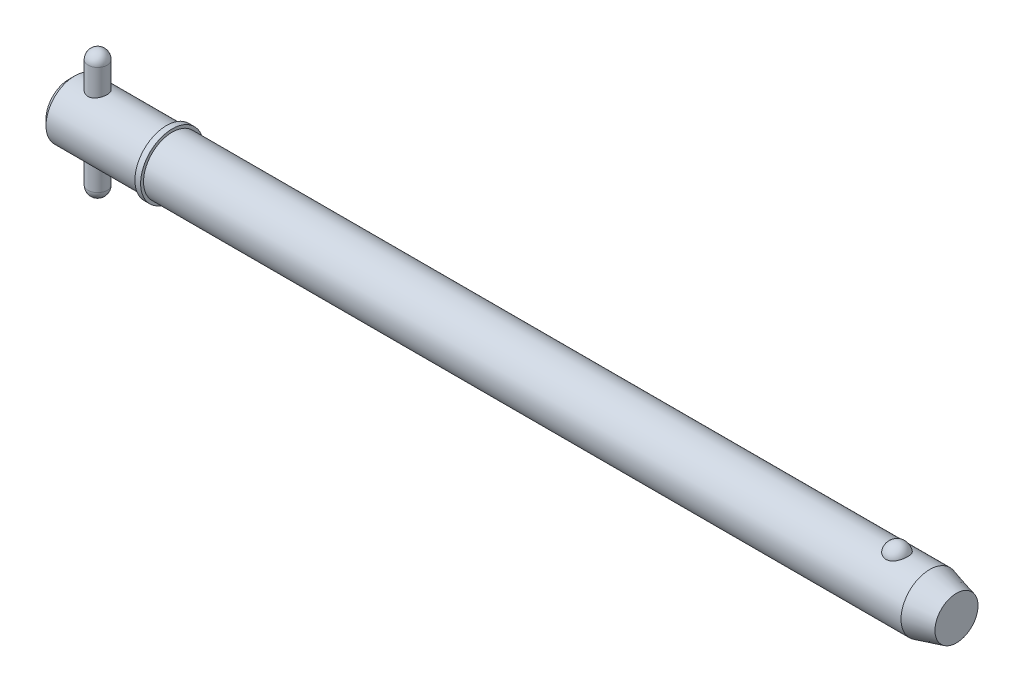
ISO-10303-21;
HEADER;
FILE_DESCRIPTION(('STEP AP214'),'2;1');
FILE_NAME('part.step','',(''),(''),'','','');
FILE_SCHEMA(('AUTOMOTIVE_DESIGN { 1 0 10303 214 1 1 1 1 }'));
ENDSEC;
DATA;
#1=APPLICATION_CONTEXT('core data for automotive mechanical design processes');
#2=APPLICATION_PROTOCOL_DEFINITION('international standard','automotive_design',2000,#1);
#3=PRODUCT_CONTEXT('',#1,'mechanical');
#4=PRODUCT('Part','Part','',(#3));
#5=PRODUCT_RELATED_PRODUCT_CATEGORY('part','',(#4));
#6=PRODUCT_DEFINITION_FORMATION('','',#4);
#7=PRODUCT_DEFINITION_CONTEXT('part definition',#1,'design');
#8=PRODUCT_DEFINITION('design','',#6,#7);
#9=PRODUCT_DEFINITION_SHAPE('','',#8);
#10=(LENGTH_UNIT() NAMED_UNIT(*) SI_UNIT(.MILLI.,.METRE.));
#11=(NAMED_UNIT(*) PLANE_ANGLE_UNIT() SI_UNIT($,.RADIAN.));
#12=(NAMED_UNIT(*) SI_UNIT($,.STERADIAN.) SOLID_ANGLE_UNIT());
#13=UNCERTAINTY_MEASURE_WITH_UNIT(LENGTH_MEASURE(1.E-05),#10,'distance_accuracy_value','');
#14=(GEOMETRIC_REPRESENTATION_CONTEXT(3) GLOBAL_UNCERTAINTY_ASSIGNED_CONTEXT((#13)) GLOBAL_UNIT_ASSIGNED_CONTEXT((#10,
#11,#12)) REPRESENTATION_CONTEXT('',''));
#15=CARTESIAN_POINT('',(0.,0.,0.));
#16=DIRECTION('',(0.,0.,1.));
#17=DIRECTION('',(1.,0.,0.));
#18=AXIS2_PLACEMENT_3D('',#15,#16,#17);
#19=CARTESIAN_POINT('',(7.14,15.875,0.));
#20=DIRECTION('',(0.,-1.,0.));
#21=DIRECTION('',(0.,0.,-1.));
#22=AXIS2_PLACEMENT_3D('',#19,#20,#21);
#23=CYLINDRICAL_SURFACE('',#22,2.38);
#24=CARTESIAN_POINT('',(7.14,-13.495,0.));
#25=DIRECTION('',(0.,-1.,0.));
#26=DIRECTION('',(0.,0.,-1.));
#27=AXIS2_PLACEMENT_3D('',#24,#25,#26);
#28=CIRCLE('',#27,2.38);
#29=CARTESIAN_POINT('',(7.14,-13.495,-2.38));
#30=VERTEX_POINT('',#29);
#31=EDGE_CURVE('P0_E10',#30,#30,#28,.F.);
#32=ORIENTED_EDGE('',*,*,#31,.T.);
#33=EDGE_LOOP('',(#32));
#34=FACE_BOUND('',#33,.T.);
#35=CARTESIAN_POINT('',(7.14,13.495,0.));
#36=DIRECTION('',(0.,-1.,0.));
#37=DIRECTION('',(0.,0.,-1.));
#38=AXIS2_PLACEMENT_3D('',#35,#36,#37);
#39=CIRCLE('',#38,2.38);
#40=CARTESIAN_POINT('',(7.14,13.495,-2.38));
#41=VERTEX_POINT('',#40);
#42=EDGE_CURVE('P0_E21',#41,#41,#39,.T.);
#43=ORIENTED_EDGE('',*,*,#42,.T.);
#44=EDGE_LOOP('',(#43));
#45=FACE_BOUND('',#44,.T.);
#46=ADVANCED_FACE('P0_F14',(#34,#45),#23,.T.);
#47=CARTESIAN_POINT('',(7.14,-13.495,0.));
#48=DIRECTION('',(0.,0.,1.));
#49=DIRECTION('',(1.,0.,0.));
#50=AXIS2_PLACEMENT_3D('',#47,#48,#49);
#51=SPHERICAL_SURFACE('',#50,2.38);
#52=CARTESIAN_POINT('',(7.14,-13.495,0.));
#53=DIRECTION('',(0.,-1.,0.));
#54=DIRECTION('',(0.,0.,-1.));
#55=AXIS2_PLACEMENT_3D('',#52,#53,#54);
#56=SPHERICAL_SURFACE('',#55,2.38);
#57=ORIENTED_EDGE('',*,*,#31,.F.);
#58=EDGE_LOOP('',(#57));
#59=FACE_BOUND('',#58,.T.);
#60=ADVANCED_FACE('P0_F29',(#59),#56,.T.);
#61=CARTESIAN_POINT('',(7.14,13.495,0.));
#62=DIRECTION('',(0.,0.,1.));
#63=DIRECTION('',(1.,0.,0.));
#64=AXIS2_PLACEMENT_3D('',#61,#62,#63);
#65=SPHERICAL_SURFACE('',#64,2.38);
#66=CARTESIAN_POINT('',(7.14,13.495,0.));
#67=DIRECTION('',(0.,-1.,0.));
#68=DIRECTION('',(0.,0.,-1.));
#69=AXIS2_PLACEMENT_3D('',#66,#67,#68);
#70=SPHERICAL_SURFACE('',#69,2.38);
#71=ORIENTED_EDGE('',*,*,#42,.F.);
#72=EDGE_LOOP('',(#71));
#73=FACE_BOUND('',#72,.T.);
#74=ADVANCED_FACE('P0_F16',(#73),#70,.T.);
#75=CLOSED_SHELL('',(#46,#60,#74));
#76=MANIFOLD_SOLID_BREP('P0_B1',#75);
#77=CARTESIAN_POINT('',(0.,0.,0.));
#78=DIRECTION('',(1.,0.,0.));
#79=DIRECTION('',(0.,0.,-1.));
#80=AXIS2_PLACEMENT_3D('',#77,#78,#79);
#81=CYLINDRICAL_SURFACE('',#80,7.145);
#82=CARTESIAN_POINT('',(214.28362424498,0.,0.));
#83=DIRECTION('',(1.,0.,0.));
#84=DIRECTION('',(0.,0.,-1.));
#85=AXIS2_PLACEMENT_3D('',#82,#83,#84);
#86=CIRCLE('',#85,7.145);
#87=CARTESIAN_POINT('',(214.28362424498,0.,-7.145));
#88=VERTEX_POINT('',#87);
#89=EDGE_CURVE('P1_E81',#88,#88,#86,.T.);
#90=ORIENTED_EDGE('',*,*,#89,.F.);
#91=EDGE_LOOP('',(#90));
#92=FACE_BOUND('',#91,.T.);
#93=CARTESIAN_POINT('',(25.7,0.,0.));
#94=DIRECTION('',(1.,0.,0.));
#95=DIRECTION('',(0.,0.,-1.));
#96=AXIS2_PLACEMENT_3D('',#93,#94,#95);
#97=CIRCLE('',#96,7.145);
#98=CARTESIAN_POINT('',(25.7,0.,-7.145));
#99=VERTEX_POINT('',#98);
#100=EDGE_CURVE('P1_E85',#99,#99,#97,.T.);
#101=ORIENTED_EDGE('',*,*,#100,.T.);
#102=EDGE_LOOP('',(#101));
#103=FACE_BOUND('',#102,.T.);
#104=CARTESIAN_POINT('',(206.139503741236,6.60328629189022,2.72903557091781));
#105=CARTESIAN_POINT('',(205.998315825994,6.60329644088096,2.72902496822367));
#106=CARTESIAN_POINT('',(205.856883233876,6.60799490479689,2.71772840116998));
#107=CARTESIAN_POINT('',(205.577955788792,6.62628236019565,2.67281935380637));
#108=CARTESIAN_POINT('',(205.440472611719,6.63989534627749,2.6391466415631));
#109=CARTESIAN_POINT('',(205.173889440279,6.67440775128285,2.55059642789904));
#110=CARTESIAN_POINT('',(205.044768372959,6.69528793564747,2.49577486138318));
#111=CARTESIAN_POINT('',(204.797869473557,6.74205585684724,2.36651799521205));
#112=CARTESIAN_POINT('',(204.680086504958,6.76794130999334,2.29209163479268));
#113=CARTESIAN_POINT('',(204.45516710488,6.82286177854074,2.12312937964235));
#114=CARTESIAN_POINT('',(204.348440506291,6.85196655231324,2.02807107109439));
#115=CARTESIAN_POINT('',(204.151918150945,6.90970232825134,1.82167822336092));
#116=CARTESIAN_POINT('',(204.062127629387,6.93833318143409,1.71033867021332));
#117=CARTESIAN_POINT('',(203.897667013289,6.9935167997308,1.46891951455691));
#118=CARTESIAN_POINT('',(203.823844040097,7.01992110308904,1.33822781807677));
#119=CARTESIAN_POINT('',(203.698088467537,7.06643385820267,1.06566567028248));
#120=CARTESIAN_POINT('',(203.64615735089,7.08654188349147,0.923794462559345));
#121=CARTESIAN_POINT('',(203.564732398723,7.11862399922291,0.630993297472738));
#122=CARTESIAN_POINT('',(203.535516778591,7.13049704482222,0.47997470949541));
#123=CARTESIAN_POINT('',(203.501174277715,7.14449484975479,0.174782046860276));
#124=CARTESIAN_POINT('',(203.496046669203,7.14661990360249,0.0206080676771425));
#125=CARTESIAN_POINT('',(203.509938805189,7.14092465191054,-0.285506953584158));
#126=CARTESIAN_POINT('',(203.528810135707,7.1331654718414,-0.437455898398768));
#127=CARTESIAN_POINT('',(203.590062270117,7.10859076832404,-0.735778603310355));
#128=CARTESIAN_POINT('',(203.632443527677,7.0917750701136,-0.882152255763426));
#129=CARTESIAN_POINT('',(203.739934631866,7.05076716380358,-1.165431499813));
#130=CARTESIAN_POINT('',(203.805075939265,7.02656475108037,-1.30232366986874));
#131=CARTESIAN_POINT('',(203.956759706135,6.97329145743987,-1.56265907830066));
#132=CARTESIAN_POINT('',(204.043303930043,6.94422017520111,-1.68610120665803));
#133=CARTESIAN_POINT('',(204.236465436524,6.88415108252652,-1.91671004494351));
#134=CARTESIAN_POINT('',(204.343180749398,6.85314438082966,-2.02379244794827));
#135=CARTESIAN_POINT('',(204.573974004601,6.79282069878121,-2.21787433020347));
#136=CARTESIAN_POINT('',(204.698050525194,6.76350358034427,-2.30487545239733));
#137=CARTESIAN_POINT('',(204.957678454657,6.71060580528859,-2.45458647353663));
#138=CARTESIAN_POINT('',(205.092938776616,6.68691885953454,-2.51776240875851));
#139=CARTESIAN_POINT('',(205.373277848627,6.64741247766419,-2.62030218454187));
#140=CARTESIAN_POINT('',(205.518352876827,6.63159007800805,-2.65967499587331));
#141=CARTESIAN_POINT('',(205.806347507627,6.61038594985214,-2.71193301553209));
#142=CARTESIAN_POINT('',(205.94900807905,6.60451880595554,-2.72605165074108));
#143=CARTESIAN_POINT('',(206.234800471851,6.60240611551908,-2.73116688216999));
#144=CARTESIAN_POINT('',(206.377932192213,6.60615862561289,-2.72216814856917));
#145=CARTESIAN_POINT('',(206.655848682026,6.62256094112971,-2.68200435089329));
#146=CARTESIAN_POINT('',(206.790754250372,6.63492533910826,-2.65154998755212));
#147=CARTESIAN_POINT('',(207.05332009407,6.66687445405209,-2.57015684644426));
#148=CARTESIAN_POINT('',(207.18097978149,6.68645975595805,-2.51921640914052));
#149=CARTESIAN_POINT('',(207.428577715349,6.73127274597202,-2.3969361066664));
#150=CARTESIAN_POINT('',(207.548287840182,6.75661381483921,-2.32517694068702));
#151=CARTESIAN_POINT('',(207.774159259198,6.81006003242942,-2.16363812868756));
#152=CARTESIAN_POINT('',(207.880317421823,6.83816581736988,-2.07385432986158));
#153=CARTESIAN_POINT('',(208.081862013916,6.8958046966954,-1.87357235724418));
#154=CARTESIAN_POINT('',(208.176440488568,6.92533863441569,-1.76226074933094));
#155=CARTESIAN_POINT('',(208.346332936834,6.981395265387,-1.52511696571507));
#156=CARTESIAN_POINT('',(208.421643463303,7.00791741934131,-1.39928219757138));
#157=CARTESIAN_POINT('',(208.553595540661,7.05607625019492,-1.13215977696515));
#158=CARTESIAN_POINT('',(208.609568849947,7.07753119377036,-0.990508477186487));
#159=CARTESIAN_POINT('',(208.698296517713,7.11222355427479,-0.699154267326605));
#160=CARTESIAN_POINT('',(208.731050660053,7.12546089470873,-0.549451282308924));
#161=CARTESIAN_POINT('',(208.772689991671,7.14237584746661,-0.246120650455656));
#162=CARTESIAN_POINT('',(208.781558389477,7.14604673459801,-0.0924903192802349));
#163=CARTESIAN_POINT('',(208.775194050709,7.14343510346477,0.214181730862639));
#164=CARTESIAN_POINT('',(208.759961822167,7.13715279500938,0.367223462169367));
#165=CARTESIAN_POINT('',(208.705845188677,7.1153294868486,0.667595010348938));
#166=CARTESIAN_POINT('',(208.667077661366,7.09983424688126,0.814949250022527));
#167=CARTESIAN_POINT('',(208.566770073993,7.06119140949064,1.10063221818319));
#168=CARTESIAN_POINT('',(208.505228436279,7.03804328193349,1.238960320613));
#169=CARTESIAN_POINT('',(208.360207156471,6.98632429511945,1.50352300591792));
#170=CARTESIAN_POINT('',(208.276606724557,6.95772382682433,1.62968561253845));
#171=CARTESIAN_POINT('',(208.08938046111,6.89823072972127,1.86554304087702));
#172=CARTESIAN_POINT('',(207.985755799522,6.86733823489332,1.97523882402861));
#173=CARTESIAN_POINT('',(207.761076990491,6.80676456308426,2.17482293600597));
#174=CARTESIAN_POINT('',(207.640067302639,6.77708053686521,2.2647603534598));
#175=CARTESIAN_POINT('',(207.383340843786,6.72230501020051,2.42252989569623));
#176=CARTESIAN_POINT('',(207.24761851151,6.69721525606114,2.49035362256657));
#177=CARTESIAN_POINT('',(206.970402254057,6.65552591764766,2.59967646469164));
#178=CARTESIAN_POINT('',(206.829281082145,6.63865794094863,2.64202017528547));
#179=CARTESIAN_POINT('',(206.541444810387,6.61425039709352,2.70255841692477));
#180=CARTESIAN_POINT('',(206.394748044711,6.60668259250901,2.72082606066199));
#181=CARTESIAN_POINT('',(206.211679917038,6.60358754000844,2.72830331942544));
#182=CARTESIAN_POINT('',(206.175599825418,6.60328369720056,2.72903828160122));
#183=CARTESIAN_POINT('',(206.139503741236,6.60328629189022,2.72903557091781));
#184=B_SPLINE_CURVE_WITH_KNOTS('',3,(#104,#105,#106,#107,#108,#109,#110,#111,#112,#113,#114,
#115,#116,#117,#118,#119,#120,#121,#122,#123,#124,#125,#126,#127,#128,#129,#130,#131,#132,#133,
#134,#135,#136,#137,#138,#139,#140,#141,#142,#143,#144,#145,#146,#147,#148,#149,#150,#151,#152,
#153,#154,#155,#156,#157,#158,#159,#160,#161,#162,#163,#164,#165,#166,#167,#168,#169,#170,#171,
#172,#173,#174,#175,#176,#177,#178,#179,#180,#181,#182,#183),.UNSPECIFIED.,.T.,.F.,(4,2,2,2,2,2,
2,2,2,2,2,2,2,2,2,2,2,2,2,2,2,2,2,2,2,2,2,2,2,2,2,2,2,2,2,2,2,2,2,4),(0.,0.423468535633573,
0.848081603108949,1.27157926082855,1.69488414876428,2.13051395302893,2.56627819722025,
3.0213670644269,3.47648674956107,3.93709649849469,4.39769233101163,4.85545355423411,
5.31322361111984,5.77162895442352,6.23007210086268,6.69080337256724,7.15149693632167,
7.60264329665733,8.05361952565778,8.48189729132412,8.91008854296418,9.32472524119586,
9.73939553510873,10.1630783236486,10.5868588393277,11.0319070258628,11.4770347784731,
11.9362874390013,12.3955443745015,12.855124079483,13.3146940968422,13.7720003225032,
14.2293382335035,14.6892343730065,15.1491036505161,15.6078171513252,16.0667046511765,
16.5093965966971,16.9507410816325,17.0590049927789),.UNSPECIFIED.);
#185=CARTESIAN_POINT('',(206.139503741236,6.60328629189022,2.72903557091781));
#186=VERTEX_POINT('',#185);
#187=EDGE_CURVE('P1_E35',#186,#186,#184,.T.);
#188=ORIENTED_EDGE('',*,*,#187,.T.);
#189=EDGE_LOOP('',(#188));
#190=FACE_BOUND('',#189,.T.);
#191=ADVANCED_FACE('P1_F13',(#92,#103,#190),#81,.T.);
#192=CARTESIAN_POINT('',(0.,0.,0.));
#193=DIRECTION('',(-1.,0.,0.));
#194=DIRECTION('',(0.,0.,1.));
#195=AXIS2_PLACEMENT_3D('',#192,#193,#194);
#196=PLANE('',#195);
#197=CARTESIAN_POINT('',(0.,0.,0.));
#198=DIRECTION('',(1.,0.,0.));
#199=DIRECTION('',(0.,0.,-1.));
#200=AXIS2_PLACEMENT_3D('',#197,#198,#199);
#201=CIRCLE('',#200,5.716);
#202=CARTESIAN_POINT('',(0.,0.,-5.716));
#203=VERTEX_POINT('',#202);
#204=EDGE_CURVE('P1_E9',#203,#203,#201,.T.);
#205=ORIENTED_EDGE('',*,*,#204,.F.);
#206=EDGE_LOOP('',(#205));
#207=FACE_BOUND('',#206,.T.);
#208=ADVANCED_FACE('P1_F15',(#207),#196,.T.);
#209=CARTESIAN_POINT('',(1.42899999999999,0.,0.));
#210=DIRECTION('',(1.,0.,0.));
#211=DIRECTION('',(0.,0.,-1.));
#212=AXIS2_PLACEMENT_3D('',#209,#210,#211);
#213=CONICAL_SURFACE('',#212,7.145,0.78539816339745);
#214=ORIENTED_EDGE('',*,*,#204,.T.);
#215=EDGE_LOOP('',(#214));
#216=FACE_BOUND('',#215,.T.);
#217=CARTESIAN_POINT('',(1.42899999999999,0.,0.));
#218=DIRECTION('',(1.,0.,0.));
#219=DIRECTION('',(0.,0.,-1.));
#220=AXIS2_PLACEMENT_3D('',#217,#218,#219);
#221=CIRCLE('',#220,7.145);
#222=CARTESIAN_POINT('',(1.42899999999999,0.,-7.145));
#223=VERTEX_POINT('',#222);
#224=EDGE_CURVE('P1_E26',#223,#223,#221,.T.);
#225=ORIENTED_EDGE('',*,*,#224,.F.);
#226=EDGE_LOOP('',(#225));
#227=FACE_BOUND('',#226,.T.);
#228=ADVANCED_FACE('P1_F77',(#216,#227),#213,.T.);
#229=CARTESIAN_POINT('',(0.,0.,0.));
#230=DIRECTION('',(1.,0.,0.));
#231=DIRECTION('',(0.,0.,-1.));
#232=AXIS2_PLACEMENT_3D('',#229,#230,#231);
#233=CYLINDRICAL_SURFACE('',#232,7.145);
#234=CARTESIAN_POINT('',(7.14,-6.73695962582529,2.38));
#235=CARTESIAN_POINT('',(7.01035997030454,-6.73695921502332,2.38000059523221));
#236=CARTESIAN_POINT('',(6.88072348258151,-6.74074253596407,2.36937183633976));
#237=CARTESIAN_POINT('',(6.62529075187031,-6.75538853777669,2.32728080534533));
#238=CARTESIAN_POINT('',(6.49949514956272,-6.76625239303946,2.29581507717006));
#239=CARTESIAN_POINT('',(6.2554858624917,-6.79369535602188,2.21327763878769));
#240=CARTESIAN_POINT('',(6.13725786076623,-6.81026326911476,2.16224430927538));
#241=CARTESIAN_POINT('',(5.91100349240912,-6.84723128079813,2.04215132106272));
#242=CARTESIAN_POINT('',(5.80297937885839,-6.86763222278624,1.97308769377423));
#243=CARTESIAN_POINT('',(5.59597854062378,-6.91086152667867,1.81600414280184));
#244=CARTESIAN_POINT('',(5.49745861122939,-6.93375032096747,1.72739874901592));
#245=CARTESIAN_POINT('',(5.31636508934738,-6.97886546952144,1.53499636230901));
#246=CARTESIAN_POINT('',(5.23379405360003,-7.00109171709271,1.43119693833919));
#247=CARTESIAN_POINT('',(5.08487013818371,-7.04307708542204,1.20801318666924));
#248=CARTESIAN_POINT('',(5.01899578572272,-7.06275685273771,1.08829330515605));
#249=CARTESIAN_POINT('',(4.90850130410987,-7.09671988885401,0.838703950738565));
#250=CARTESIAN_POINT('',(4.86387545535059,-7.11100460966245,0.70883722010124));
#251=CARTESIAN_POINT('',(4.79869354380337,-7.13213998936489,0.44742990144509));
#252=CARTESIAN_POINT('',(4.77735497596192,-7.13923172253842,0.316104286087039));
#253=CARTESIAN_POINT('',(4.75686536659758,-7.14603777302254,0.0515578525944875));
#254=CARTESIAN_POINT('',(4.75770861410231,-7.14575398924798,-0.0816624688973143));
#255=CARTESIAN_POINT('',(4.78106216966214,-7.13800438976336,-0.340678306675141));
#256=CARTESIAN_POINT('',(4.80272255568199,-7.13082030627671,-0.466560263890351));
#257=CARTESIAN_POINT('',(4.86569013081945,-7.11043095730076,-0.712788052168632));
#258=CARTESIAN_POINT('',(4.90699865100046,-7.09722528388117,-0.833133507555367));
#259=CARTESIAN_POINT('',(5.00858673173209,-7.06591754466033,-1.06673173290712));
#260=CARTESIAN_POINT('',(5.06910834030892,-7.0477534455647,-1.17987058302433));
#261=CARTESIAN_POINT('',(5.20720514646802,-7.00841977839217,-1.39463797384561));
#262=CARTESIAN_POINT('',(5.28478508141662,-6.987249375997,-1.49626330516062));
#263=CARTESIAN_POINT('',(5.4590800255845,-6.94296010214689,-1.69017445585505));
#264=CARTESIAN_POINT('',(5.55652324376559,-6.91979641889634,-1.78179645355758));
#265=CARTESIAN_POINT('',(5.76558873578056,-6.87497076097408,-1.94761348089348));
#266=CARTESIAN_POINT('',(5.87721318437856,-6.85330901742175,-2.02180583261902));
#267=CARTESIAN_POINT('',(6.11357367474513,-6.81369485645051,-2.15157488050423));
#268=CARTESIAN_POINT('',(6.23847358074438,-6.79579956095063,-2.20687188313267));
#269=CARTESIAN_POINT('',(6.49655785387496,-6.76640630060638,-2.29542443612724));
#270=CARTESIAN_POINT('',(6.62973872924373,-6.75490565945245,-2.32868920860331));
#271=CARTESIAN_POINT('',(6.89417536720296,-6.74020933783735,-2.37088225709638));
#272=CARTESIAN_POINT('',(7.02524746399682,-6.73666278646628,-2.38083959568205));
#273=CARTESIAN_POINT('',(7.28721035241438,-6.73729555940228,-2.37904974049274));
#274=CARTESIAN_POINT('',(7.41810117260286,-6.7414734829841,-2.36730648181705));
#275=CARTESIAN_POINT('',(7.67130717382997,-6.75673471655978,-2.32337336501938));
#276=CARTESIAN_POINT('',(7.79376251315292,-6.76757635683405,-2.29189834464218));
#277=CARTESIAN_POINT('',(8.03162917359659,-6.79467771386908,-2.21025275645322));
#278=CARTESIAN_POINT('',(8.14703924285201,-6.8109383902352,-2.16007887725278));
#279=CARTESIAN_POINT('',(8.37159169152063,-6.84768362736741,-2.04065289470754));
#280=CARTESIAN_POINT('',(8.48041962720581,-6.86828569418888,-1.97084668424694));
#281=CARTESIAN_POINT('',(8.68518919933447,-6.91116416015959,-1.8147657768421));
#282=CARTESIAN_POINT('',(8.78112702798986,-6.93344105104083,-1.72848623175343));
#283=CARTESIAN_POINT('',(8.96215574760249,-6.97845348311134,-1.53698616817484));
#284=CARTESIAN_POINT('',(9.04650427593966,-7.00115965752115,-1.43105491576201));
#285=CARTESIAN_POINT('',(9.19627592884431,-7.04341676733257,-1.20598377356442));
#286=CARTESIAN_POINT('',(9.26169972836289,-7.06296781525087,-1.08684435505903));
#287=CARTESIAN_POINT('',(9.37116617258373,-7.0966205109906,-0.83933303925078));
#288=CARTESIAN_POINT('',(9.41534821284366,-7.11075755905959,-0.711027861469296));
#289=CARTESIAN_POINT('',(9.48132660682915,-7.13214194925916,-0.448245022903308));
#290=CARTESIAN_POINT('',(9.50313102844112,-7.13939177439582,-0.313769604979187));
#291=CARTESIAN_POINT('',(9.5230098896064,-7.14599771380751,-0.049254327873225));
#292=CARTESIAN_POINT('',(9.52215013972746,-7.14570837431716,0.0806974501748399));
#293=CARTESIAN_POINT('',(9.49935359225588,-7.13814116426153,0.338518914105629));
#294=CARTESIAN_POINT('',(9.47741850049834,-7.13086385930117,0.466388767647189));
#295=CARTESIAN_POINT('',(9.4138005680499,-7.11026814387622,0.714400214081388));
#296=CARTESIAN_POINT('',(9.37243609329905,-7.09704726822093,0.834632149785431));
#297=CARTESIAN_POINT('',(9.27142829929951,-7.06592602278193,1.06649582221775));
#298=CARTESIAN_POINT('',(9.2117816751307,-7.04802480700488,1.1781259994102));
#299=CARTESIAN_POINT('',(9.07336776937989,-7.00856499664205,1.39411030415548));
#300=CARTESIAN_POINT('',(8.99397590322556,-6.98689577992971,1.49804368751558));
#301=CARTESIAN_POINT('',(8.81938810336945,-6.9426110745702,1.69146078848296));
#302=CARTESIAN_POINT('',(8.72418713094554,-6.91999528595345,1.78093988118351));
#303=CARTESIAN_POINT('',(8.51623540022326,-6.87531507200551,1.94646188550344));
#304=CARTESIAN_POINT('',(8.4029442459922,-6.85330672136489,2.02184316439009));
#305=CARTESIAN_POINT('',(8.16461714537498,-6.81342065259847,2.1524427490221));
#306=CARTESIAN_POINT('',(8.03958429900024,-6.7955418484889,2.20766635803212));
#307=CARTESIAN_POINT('',(7.78712566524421,-6.76686117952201,2.29403636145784));
#308=CARTESIAN_POINT('',(7.66006989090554,-6.75577342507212,2.32616709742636));
#309=CARTESIAN_POINT('',(7.40200728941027,-6.74082409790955,2.36914495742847));
#310=CARTESIAN_POINT('',(7.27100183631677,-6.73696004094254,2.37999939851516));
#311=CARTESIAN_POINT('',(7.14,-6.73695962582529,2.38));
#312=B_SPLINE_CURVE_WITH_KNOTS('',3,(#234,#235,#236,#237,#238,#239,#240,#241,#242,#243,#244,
#245,#246,#247,#248,#249,#250,#251,#252,#253,#254,#255,#256,#257,#258,#259,#260,#261,#262,#263,
#264,#265,#266,#267,#268,#269,#270,#271,#272,#273,#274,#275,#276,#277,#278,#279,#280,#281,#282,
#283,#284,#285,#286,#287,#288,#289,#290,#291,#292,#293,#294,#295,#296,#297,#298,#299,#300,#301,
#302,#303,#304,#305,#306,#307,#308,#309,#310,#311),.UNSPECIFIED.,.T.,.F.,(4,2,2,2,2,2,2,2,2,2,2,
2,2,2,2,2,2,2,2,2,2,2,2,2,2,2,2,2,2,2,2,2,2,2,2,2,2,2,4),(0.,0.388434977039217,
0.776934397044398,1.16467566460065,1.55250234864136,1.9540847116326,2.35573139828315,
2.76784120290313,3.17984001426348,3.57752248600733,3.97510257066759,4.35711073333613,
4.7391447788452,5.12619663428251,5.51335611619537,5.91871976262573,6.3241456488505,
6.73533623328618,7.14635459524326,7.53885245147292,7.93127914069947,8.31025106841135,
8.68929014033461,9.08033871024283,9.47150254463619,9.88145528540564,10.2913934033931,
10.6986033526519,11.1056664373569,11.4936225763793,11.8815473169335,12.2633262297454,
12.645174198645,13.0411187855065,13.437189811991,13.8487371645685,14.2601761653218,
14.6528265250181,15.0453418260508),.UNSPECIFIED.);
#313=CARTESIAN_POINT('',(7.14,-6.73695962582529,2.38));
#314=VERTEX_POINT('',#313);
#315=EDGE_CURVE('P1_E17',#314,#314,#312,.T.);
#316=ORIENTED_EDGE('',*,*,#315,.F.);
#317=EDGE_LOOP('',(#316));
#318=FACE_BOUND('',#317,.T.);
#319=CARTESIAN_POINT('',(7.14,6.73695962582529,2.38));
#320=CARTESIAN_POINT('',(7.26964002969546,6.73695921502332,2.38000059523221));
#321=CARTESIAN_POINT('',(7.39927651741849,6.74074253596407,2.36937183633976));
#322=CARTESIAN_POINT('',(7.65470924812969,6.75538853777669,2.32728080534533));
#323=CARTESIAN_POINT('',(7.78050485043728,6.76625239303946,2.29581507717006));
#324=CARTESIAN_POINT('',(8.02451413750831,6.79369535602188,2.21327763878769));
#325=CARTESIAN_POINT('',(8.14274213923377,6.81026326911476,2.16224430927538));
#326=CARTESIAN_POINT('',(8.36899650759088,6.84723128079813,2.04215132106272));
#327=CARTESIAN_POINT('',(8.47702062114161,6.86763222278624,1.97308769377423));
#328=CARTESIAN_POINT('',(8.68402145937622,6.91086152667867,1.81600414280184));
#329=CARTESIAN_POINT('',(8.78254138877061,6.93375032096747,1.72739874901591));
#330=CARTESIAN_POINT('',(8.96363491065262,6.97886546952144,1.53499636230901));
#331=CARTESIAN_POINT('',(9.04620594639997,7.00109171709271,1.43119693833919));
#332=CARTESIAN_POINT('',(9.19512986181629,7.04307708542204,1.20801318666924));
#333=CARTESIAN_POINT('',(9.26100421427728,7.06275685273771,1.08829330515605));
#334=CARTESIAN_POINT('',(9.37149869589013,7.09671988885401,0.838703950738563));
#335=CARTESIAN_POINT('',(9.41612454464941,7.11100460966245,0.708837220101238));
#336=CARTESIAN_POINT('',(9.48130645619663,7.13213998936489,0.447429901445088));
#337=CARTESIAN_POINT('',(9.50264502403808,7.13923172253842,0.316104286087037));
#338=CARTESIAN_POINT('',(9.52313463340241,7.14603777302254,0.0515578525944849));
#339=CARTESIAN_POINT('',(9.52229138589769,7.14575398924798,-0.0816624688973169));
#340=CARTESIAN_POINT('',(9.49893783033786,7.13800438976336,-0.340678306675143));
#341=CARTESIAN_POINT('',(9.47727744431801,7.13082030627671,-0.466560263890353));
#342=CARTESIAN_POINT('',(9.41430986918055,7.11043095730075,-0.712788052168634));
#343=CARTESIAN_POINT('',(9.37300134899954,7.09722528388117,-0.833133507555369));
#344=CARTESIAN_POINT('',(9.27141326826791,7.06591754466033,-1.06673173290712));
#345=CARTESIAN_POINT('',(9.21089165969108,7.0477534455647,-1.17987058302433));
#346=CARTESIAN_POINT('',(9.07279485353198,7.00841977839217,-1.39463797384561));
#347=CARTESIAN_POINT('',(8.99521491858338,6.987249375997,-1.49626330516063));
#348=CARTESIAN_POINT('',(8.82091997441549,6.94296010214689,-1.69017445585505));
#349=CARTESIAN_POINT('',(8.72347675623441,6.91979641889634,-1.78179645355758));
#350=CARTESIAN_POINT('',(8.51441126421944,6.87497076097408,-1.94761348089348));
#351=CARTESIAN_POINT('',(8.40278681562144,6.85330901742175,-2.02180583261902));
#352=CARTESIAN_POINT('',(8.16642632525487,6.81369485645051,-2.15157488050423));
#353=CARTESIAN_POINT('',(8.04152641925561,6.79579956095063,-2.20687188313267));
#354=CARTESIAN_POINT('',(7.78344214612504,6.76640630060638,-2.29542443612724));
#355=CARTESIAN_POINT('',(7.65026127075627,6.75490565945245,-2.32868920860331));
#356=CARTESIAN_POINT('',(7.38582463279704,6.74020933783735,-2.37088225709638));
#357=CARTESIAN_POINT('',(7.25475253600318,6.73666278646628,-2.38083959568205));
#358=CARTESIAN_POINT('',(6.99278964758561,6.73729555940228,-2.37904974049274));
#359=CARTESIAN_POINT('',(6.86189882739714,6.7414734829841,-2.36730648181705));
#360=CARTESIAN_POINT('',(6.60869282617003,6.75673471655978,-2.32337336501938));
#361=CARTESIAN_POINT('',(6.48623748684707,6.76757635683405,-2.29189834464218));
#362=CARTESIAN_POINT('',(6.2483708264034,6.79467771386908,-2.21025275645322));
#363=CARTESIAN_POINT('',(6.13296075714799,6.8109383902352,-2.16007887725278));
#364=CARTESIAN_POINT('',(5.90840830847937,6.84768362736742,-2.04065289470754));
#365=CARTESIAN_POINT('',(5.79958037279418,6.86828569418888,-1.97084668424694));
#366=CARTESIAN_POINT('',(5.59481080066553,6.91116416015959,-1.8147657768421));
#367=CARTESIAN_POINT('',(5.49887297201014,6.93344105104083,-1.72848623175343));
#368=CARTESIAN_POINT('',(5.31784425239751,6.97845348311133,-1.53698616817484));
#369=CARTESIAN_POINT('',(5.23349572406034,7.00115965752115,-1.43105491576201));
#370=CARTESIAN_POINT('',(5.08372407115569,7.04341676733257,-1.20598377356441));
#371=CARTESIAN_POINT('',(5.01830027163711,7.06296781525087,-1.08684435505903));
#372=CARTESIAN_POINT('',(4.90883382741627,7.0966205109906,-0.839333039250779));
#373=CARTESIAN_POINT('',(4.86465178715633,7.11075755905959,-0.711027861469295));
#374=CARTESIAN_POINT('',(4.79867339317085,7.13214194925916,-0.448245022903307));
#375=CARTESIAN_POINT('',(4.77686897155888,7.13939177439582,-0.313769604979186));
#376=CARTESIAN_POINT('',(4.7569901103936,7.14599771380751,-0.0492543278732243));
#377=CARTESIAN_POINT('',(4.75784986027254,7.14570837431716,0.0806974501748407));
#378=CARTESIAN_POINT('',(4.78064640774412,7.13814116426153,0.33851891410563));
#379=CARTESIAN_POINT('',(4.80258149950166,7.13086385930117,0.46638876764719));
#380=CARTESIAN_POINT('',(4.8661994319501,7.11026814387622,0.714400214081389));
#381=CARTESIAN_POINT('',(4.90756390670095,7.09704726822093,0.834632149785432));
#382=CARTESIAN_POINT('',(5.00857170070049,7.06592602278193,1.06649582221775));
#383=CARTESIAN_POINT('',(5.0682183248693,7.04802480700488,1.1781259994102));
#384=CARTESIAN_POINT('',(5.20663223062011,7.00856499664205,1.39411030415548));
#385=CARTESIAN_POINT('',(5.28602409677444,6.98689577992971,1.49804368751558));
#386=CARTESIAN_POINT('',(5.46061189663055,6.9426110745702,1.69146078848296));
#387=CARTESIAN_POINT('',(5.55581286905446,6.91999528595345,1.78093988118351));
#388=CARTESIAN_POINT('',(5.76376459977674,6.87531507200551,1.94646188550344));
#389=CARTESIAN_POINT('',(5.8770557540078,6.85330672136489,2.02184316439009));
#390=CARTESIAN_POINT('',(6.11538285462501,6.81342065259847,2.1524427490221));
#391=CARTESIAN_POINT('',(6.24041570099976,6.7955418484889,2.20766635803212));
#392=CARTESIAN_POINT('',(6.4928743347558,6.76686117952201,2.29403636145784));
#393=CARTESIAN_POINT('',(6.61993010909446,6.75577342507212,2.32616709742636));
#394=CARTESIAN_POINT('',(6.87799271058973,6.74082409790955,2.36914495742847));
#395=CARTESIAN_POINT('',(7.00899816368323,6.73696004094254,2.37999939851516));
#396=CARTESIAN_POINT('',(7.14,6.73695962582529,2.38));
#397=B_SPLINE_CURVE_WITH_KNOTS('',3,(#319,#320,#321,#322,#323,#324,#325,#326,#327,#328,#329,
#330,#331,#332,#333,#334,#335,#336,#337,#338,#339,#340,#341,#342,#343,#344,#345,#346,#347,#348,
#349,#350,#351,#352,#353,#354,#355,#356,#357,#358,#359,#360,#361,#362,#363,#364,#365,#366,#367,
#368,#369,#370,#371,#372,#373,#374,#375,#376,#377,#378,#379,#380,#381,#382,#383,#384,#385,#386,
#387,#388,#389,#390,#391,#392,#393,#394,#395,#396),.UNSPECIFIED.,.T.,.F.,(4,2,2,2,2,2,2,2,2,2,2,
2,2,2,2,2,2,2,2,2,2,2,2,2,2,2,2,2,2,2,2,2,2,2,2,2,2,2,4),(0.,0.388434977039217,
0.776934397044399,1.16467566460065,1.55250234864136,1.9540847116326,2.35573139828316,
2.76784120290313,3.17984001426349,3.57752248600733,3.97510257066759,4.35711073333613,
4.73914477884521,5.12619663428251,5.51335611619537,5.91871976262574,6.3241456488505,
6.73533623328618,7.14635459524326,7.53885245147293,7.93127914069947,8.31025106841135,
8.68929014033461,9.08033871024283,9.47150254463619,9.88145528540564,10.2913934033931,
10.6986033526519,11.1056664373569,11.4936225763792,11.8815473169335,12.2633262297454,
12.645174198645,13.0411187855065,13.437189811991,13.8487371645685,14.2601761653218,
14.6528265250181,15.0453418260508),.UNSPECIFIED.);
#398=CARTESIAN_POINT('',(7.14,6.73695962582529,2.38));
#399=VERTEX_POINT('',#398);
#400=EDGE_CURVE('P1_E43',#399,#399,#397,.T.);
#401=ORIENTED_EDGE('',*,*,#400,.F.);
#402=EDGE_LOOP('',(#401));
#403=FACE_BOUND('',#402,.T.);
#404=ORIENTED_EDGE('',*,*,#224,.T.);
#405=EDGE_LOOP('',(#404));
#406=FACE_BOUND('',#405,.T.);
#407=CARTESIAN_POINT('',(24.271,0.,0.));
#408=DIRECTION('',(1.,0.,0.));
#409=DIRECTION('',(0.,0.,-1.));
#410=AXIS2_PLACEMENT_3D('',#407,#408,#409);
#411=CIRCLE('',#410,7.145);
#412=CARTESIAN_POINT('',(24.271,0.,-7.145));
#413=VERTEX_POINT('',#412);
#414=EDGE_CURVE('P1_E31',#413,#413,#411,.T.);
#415=ORIENTED_EDGE('',*,*,#414,.F.);
#416=EDGE_LOOP('',(#415));
#417=FACE_BOUND('',#416,.T.);
#418=ADVANCED_FACE('P1_F103',(#318,#403,#406,#417),#233,.T.);
#419=CARTESIAN_POINT('',(24.271,7.145,0.));
#420=DIRECTION('',(-1.,0.,0.));
#421=DIRECTION('',(0.,0.,1.));
#422=AXIS2_PLACEMENT_3D('',#419,#420,#421);
#423=PLANE('',#422);
#424=ORIENTED_EDGE('',*,*,#414,.T.);
#425=EDGE_LOOP('',(#424));
#426=FACE_BOUND('',#425,.T.);
#427=CARTESIAN_POINT('',(24.271,0.,0.));
#428=DIRECTION('',(1.,0.,0.));
#429=DIRECTION('',(0.,0.,-1.));
#430=AXIS2_PLACEMENT_3D('',#427,#428,#429);
#431=CIRCLE('',#430,7.8595);
#432=CARTESIAN_POINT('',(24.271,0.,-7.8595));
#433=VERTEX_POINT('',#432);
#434=EDGE_CURVE('P1_E91',#433,#433,#431,.T.);
#435=ORIENTED_EDGE('',*,*,#434,.F.);
#436=EDGE_LOOP('',(#435));
#437=FACE_BOUND('',#436,.T.);
#438=ADVANCED_FACE('P1_F100',(#426,#437),#423,.T.);
#439=CARTESIAN_POINT('',(0.,0.,0.));
#440=DIRECTION('',(1.,0.,0.));
#441=DIRECTION('',(0.,0.,-1.));
#442=AXIS2_PLACEMENT_3D('',#439,#440,#441);
#443=CYLINDRICAL_SURFACE('',#442,7.8595);
#444=ORIENTED_EDGE('',*,*,#434,.T.);
#445=EDGE_LOOP('',(#444));
#446=FACE_BOUND('',#445,.T.);
#447=CARTESIAN_POINT('',(25.7,0.,0.));
#448=DIRECTION('',(1.,0.,0.));
#449=DIRECTION('',(0.,0.,-1.));
#450=AXIS2_PLACEMENT_3D('',#447,#448,#449);
#451=CIRCLE('',#450,7.8595);
#452=CARTESIAN_POINT('',(25.7,0.,-7.8595));
#453=VERTEX_POINT('',#452);
#454=EDGE_CURVE('P1_E88',#453,#453,#451,.T.);
#455=ORIENTED_EDGE('',*,*,#454,.F.);
#456=EDGE_LOOP('',(#455));
#457=FACE_BOUND('',#456,.T.);
#458=ADVANCED_FACE('P1_F68',(#446,#457),#443,.T.);
#459=CARTESIAN_POINT('',(25.7,7.8595,0.));
#460=DIRECTION('',(1.,0.,0.));
#461=DIRECTION('',(0.,0.,-1.));
#462=AXIS2_PLACEMENT_3D('',#459,#460,#461);
#463=PLANE('',#462);
#464=ORIENTED_EDGE('',*,*,#454,.T.);
#465=EDGE_LOOP('',(#464));
#466=FACE_BOUND('',#465,.T.);
#467=ORIENTED_EDGE('',*,*,#100,.F.);
#468=EDGE_LOOP('',(#467));
#469=FACE_BOUND('',#468,.T.);
#470=ADVANCED_FACE('P1_F62',(#466,#469),#463,.T.);
#471=CARTESIAN_POINT('',(220.95,0.,0.));
#472=DIRECTION('',(-1.,0.,0.));
#473=DIRECTION('',(0.,0.,1.));
#474=AXIS2_PLACEMENT_3D('',#471,#472,#473);
#475=CONICAL_SURFACE('',#474,5.35875000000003,0.26179938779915);
#476=ORIENTED_EDGE('',*,*,#89,.T.);
#477=EDGE_LOOP('',(#476));
#478=FACE_BOUND('',#477,.T.);
#479=CARTESIAN_POINT('',(220.95,0.,0.));
#480=DIRECTION('',(1.,0.,0.));
#481=DIRECTION('',(0.,0.,-1.));
#482=AXIS2_PLACEMENT_3D('',#479,#480,#481);
#483=CIRCLE('',#482,5.35875000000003);
#484=CARTESIAN_POINT('',(220.95,0.,-5.35875000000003));
#485=VERTEX_POINT('',#484);
#486=EDGE_CURVE('P1_E42',#485,#485,#483,.T.);
#487=ORIENTED_EDGE('',*,*,#486,.F.);
#488=EDGE_LOOP('',(#487));
#489=FACE_BOUND('',#488,.T.);
#490=ADVANCED_FACE('P1_F59',(#478,#489),#475,.T.);
#491=CARTESIAN_POINT('',(220.95,5.35875000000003,0.));
#492=DIRECTION('',(1.,0.,0.));
#493=DIRECTION('',(0.,0.,-1.));
#494=AXIS2_PLACEMENT_3D('',#491,#492,#493);
#495=PLANE('',#494);
#496=ORIENTED_EDGE('',*,*,#486,.T.);
#497=EDGE_LOOP('',(#496));
#498=FACE_BOUND('',#497,.T.);
#499=ADVANCED_FACE('P1_F55',(#498),#495,.T.);
#500=CARTESIAN_POINT('',(206.139503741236,6.4305,0.));
#501=DIRECTION('',(-1.,0.,0.));
#502=DIRECTION('',(0.,-1.,0.));
#503=AXIS2_PLACEMENT_3D('',#500,#501,#502);
#504=SPHERICAL_SURFACE('',#503,2.73449999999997);
#505=ORIENTED_EDGE('',*,*,#187,.F.);
#506=EDGE_LOOP('',(#505));
#507=FACE_BOUND('',#506,.T.);
#508=ADVANCED_FACE('P1_F50',(#507),#504,.T.);
#509=CARTESIAN_POINT('',(7.14,-7.8595,0.));
#510=DIRECTION('',(0.,1.,0.));
#511=DIRECTION('',(0.,0.,1.));
#512=AXIS2_PLACEMENT_3D('',#509,#510,#511);
#513=CYLINDRICAL_SURFACE('',#512,2.38);
#514=ORIENTED_EDGE('',*,*,#315,.T.);
#515=EDGE_LOOP('',(#514));
#516=FACE_BOUND('',#515,.T.);
#517=ORIENTED_EDGE('',*,*,#400,.T.);
#518=EDGE_LOOP('',(#517));
#519=FACE_BOUND('',#518,.T.);
#520=ADVANCED_FACE('P1_F54',(#516,#519),#513,.F.);
#521=CLOSED_SHELL('',(#191,#208,#228,#418,#438,#458,#470,#490,#499,#508,#520));
#522=MANIFOLD_SOLID_BREP('P1_B1',#521);
#523=ADVANCED_BREP_SHAPE_REPRESENTATION('',(#18,#76,#522),#14);
#524=SHAPE_DEFINITION_REPRESENTATION(#9,#523);
ENDSEC;
END-ISO-10303-21;
